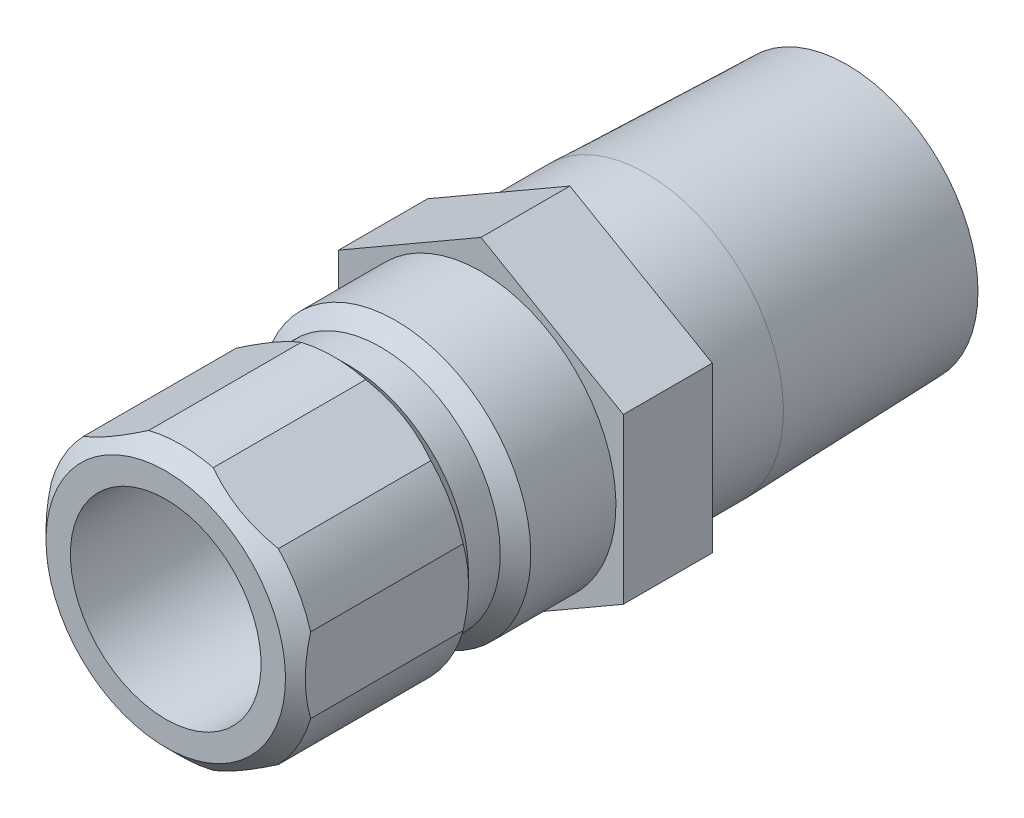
from build123d import *

# Parameters (mm, degrees)
SKETCH2_R           = 4.6228
BOSS_EXTRUDE1_DEPTH = 4.445
CUT_EXTRUDE1_START  = 6.604
SKETCH3_OUTSIDE_W   = 24.3
SKETCH3_OUTSIDE_H   = 26.5
SKETCH3_OUTSIDE_R   = 4.6228
CUT_EXTRUDE1_DEPTH  = 15.66739425


with BuildPart() as part:
    # Sketch1 → Revolve1 (revolve)
    with BuildSketch(Plane(origin=(0, 0, 0), x_dir=(0, 0, -1), z_dir=(1, 0, 0))):
        Polygon((-15.748, 4.7625), (-15.748, 5.9817), (-14.986, 6.7437), (-7.366, 6.7437), (-6.604, 5.9817), (-5.0165, 5.9817), (-4.2545, 6.7437), (0, 6.7437), (0, 6.858), (8.255, 6.858), (18.288, 6.544470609), (18.288, 4.6228), (-3.481720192, 4.6228), (-3.556, 4.7625), align=None)
    revolve(axis=Axis((0, 0, 0), (0, 0, 1)))

    # Sketch2 → Boss-Extrude1 (add)
    with BuildSketch(Plane.XY):
        Polygon((-7.112, 4.106115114), (-7.112, -4.106115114), (0, -8.212230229), (7.112, -4.106115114), (7.112, 4.106115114), (0, 8.212230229), align=None)
        with Locations(Location((0, 0, 0), (0, 0, 90))):
            Circle(SKETCH2_R, mode=Mode.SUBTRACT)
    extrude(amount=-BOSS_EXTRUDE1_DEPTH)

    # Sketch3 outside → Cut-Extrude1 (cut, through all)
    # profile 1 of 2: a face of its own
    with BuildSketch(Plane.XY.offset(CUT_EXTRUDE1_START)):
        Rectangle(SKETCH3_OUTSIDE_W, SKETCH3_OUTSIDE_H)
        Polygon((-6.477, 3.739497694), (-6.477, -3.739497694), (0, -7.478995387), (6.477, -3.739497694), (6.477, 3.739497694), (0, 7.478995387), align=None, mode=Mode.SUBTRACT)
    # profile 2 of 2: a face of its own
    with BuildSketch(Plane.XY.offset(CUT_EXTRUDE1_START)):
        with Locations(Location((0, 0, 0), (0, 0, 90))):
            Circle(SKETCH3_OUTSIDE_R)
    extrude(amount=CUT_EXTRUDE1_DEPTH, mode=Mode.SUBTRACT)


solid = part.part
